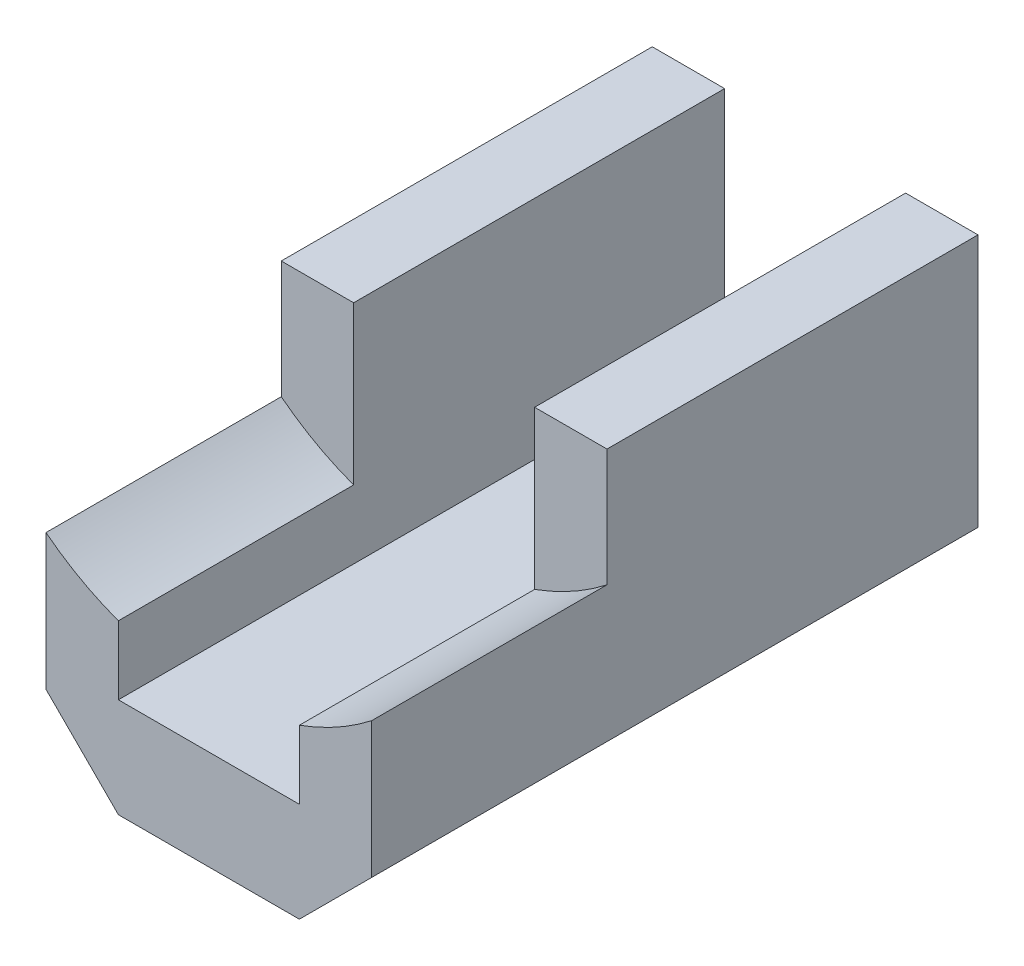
ISO-10303-21;
HEADER;
FILE_DESCRIPTION(('STEP AP214'),'2;1');
FILE_NAME('part.step','',(''),(''),'','','');
FILE_SCHEMA(('AUTOMOTIVE_DESIGN { 1 0 10303 214 1 1 1 1 }'));
ENDSEC;
DATA;
#1=APPLICATION_CONTEXT('core data for automotive mechanical design processes');
#2=APPLICATION_PROTOCOL_DEFINITION('international standard','automotive_design',2000,#1);
#3=PRODUCT_CONTEXT('',#1,'mechanical');
#4=PRODUCT('Part','Part','',(#3));
#5=PRODUCT_RELATED_PRODUCT_CATEGORY('part','',(#4));
#6=PRODUCT_DEFINITION_FORMATION('','',#4);
#7=PRODUCT_DEFINITION_CONTEXT('part definition',#1,'design');
#8=PRODUCT_DEFINITION('design','',#6,#7);
#9=PRODUCT_DEFINITION_SHAPE('','',#8);
#10=(LENGTH_UNIT() NAMED_UNIT(*) SI_UNIT(.MILLI.,.METRE.));
#11=(NAMED_UNIT(*) PLANE_ANGLE_UNIT() SI_UNIT($,.RADIAN.));
#12=(NAMED_UNIT(*) SI_UNIT($,.STERADIAN.) SOLID_ANGLE_UNIT());
#13=UNCERTAINTY_MEASURE_WITH_UNIT(LENGTH_MEASURE(1.E-05),#10,'distance_accuracy_value','');
#14=(GEOMETRIC_REPRESENTATION_CONTEXT(3) GLOBAL_UNCERTAINTY_ASSIGNED_CONTEXT((#13)) GLOBAL_UNIT_ASSIGNED_CONTEXT((#10,
#11,#12)) REPRESENTATION_CONTEXT('',''));
#15=CARTESIAN_POINT('',(0.,0.,0.));
#16=DIRECTION('',(0.,0.,1.));
#17=DIRECTION('',(1.,0.,0.));
#18=AXIS2_PLACEMENT_3D('',#15,#16,#17);
#19=CARTESIAN_POINT('',(9.,7.5,33.5));
#20=DIRECTION('',(-1.,0.,0.));
#21=DIRECTION('',(0.,0.,1.));
#22=AXIS2_PLACEMENT_3D('',#19,#20,#21);
#23=PLANE('',#22);
#24=DIRECTION('',(0.,1.,0.));
#25=VECTOR('',#24,1.);
#26=CARTESIAN_POINT('',(9.,7.5,33.5));
#27=LINE('',#26,#25);
#28=CARTESIAN_POINT('',(9.,-3.5,33.5));
#29=VERTEX_POINT('',#28);
#30=CARTESIAN_POINT('',(9.,4.00391370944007,33.5));
#31=VERTEX_POINT('',#30);
#32=EDGE_CURVE('E217',#29,#31,#27,.T.);
#33=ORIENTED_EDGE('',*,*,#32,.F.);
#34=DIRECTION('',(0.,0.,-1.));
#35=VECTOR('',#34,1.);
#36=CARTESIAN_POINT('',(9.,-3.5,33.5));
#37=LINE('',#36,#35);
#38=CARTESIAN_POINT('',(9.,-3.5,0.));
#39=VERTEX_POINT('',#38);
#40=EDGE_CURVE('E127',#29,#39,#37,.T.);
#41=ORIENTED_EDGE('',*,*,#40,.T.);
#42=DIRECTION('',(0.,1.,0.));
#43=VECTOR('',#42,1.);
#44=CARTESIAN_POINT('',(9.,7.5,0.));
#45=LINE('',#44,#43);
#46=CARTESIAN_POINT('',(9.,10.5,0.));
#47=VERTEX_POINT('',#46);
#48=EDGE_CURVE('E120',#39,#47,#45,.T.);
#49=ORIENTED_EDGE('',*,*,#48,.T.);
#50=DIRECTION('',(0.,0.,-1.));
#51=VECTOR('',#50,1.);
#52=CARTESIAN_POINT('',(9.,10.5,33.5));
#53=LINE('',#52,#51);
#54=CARTESIAN_POINT('',(9.,10.5,20.5));
#55=VERTEX_POINT('',#54);
#56=EDGE_CURVE('E124',#55,#47,#53,.T.);
#57=ORIENTED_EDGE('',*,*,#56,.F.);
#58=DIRECTION('',(0.,1.,0.));
#59=VECTOR('',#58,1.);
#60=CARTESIAN_POINT('',(9.,7.5,20.5));
#61=LINE('',#60,#59);
#62=CARTESIAN_POINT('',(9.,4.00391370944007,20.5));
#63=VERTEX_POINT('',#62);
#64=EDGE_CURVE('E167',#63,#55,#61,.T.);
#65=ORIENTED_EDGE('',*,*,#64,.F.);
#66=DIRECTION('',(0.,0.,1.));
#67=VECTOR('',#66,1.);
#68=CARTESIAN_POINT('',(9.,4.00391370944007,20.5));
#69=LINE('',#68,#67);
#70=EDGE_CURVE('E175',#63,#31,#69,.T.);
#71=ORIENTED_EDGE('',*,*,#70,.T.);
#72=EDGE_LOOP('',(#33,#41,#49,#57,#65,#71));
#73=FACE_BOUND('',#72,.T.);
#74=ADVANCED_FACE('F16',(#73),#23,.F.);
#75=CARTESIAN_POINT('',(-9.,7.5,33.5));
#76=DIRECTION('',(1.,0.,0.));
#77=DIRECTION('',(0.,1.,0.));
#78=AXIS2_PLACEMENT_3D('',#75,#76,#77);
#79=PLANE('',#78);
#80=DIRECTION('',(0.,-1.,0.));
#81=VECTOR('',#80,1.);
#82=CARTESIAN_POINT('',(-9.,7.5,0.));
#83=LINE('',#82,#81);
#84=CARTESIAN_POINT('',(-9.,10.5,0.));
#85=VERTEX_POINT('',#84);
#86=CARTESIAN_POINT('',(-9.,-3.5,0.));
#87=VERTEX_POINT('',#86);
#88=EDGE_CURVE('E130',#85,#87,#83,.T.);
#89=ORIENTED_EDGE('',*,*,#88,.T.);
#90=DIRECTION('',(0.,0.,1.));
#91=VECTOR('',#90,1.);
#92=CARTESIAN_POINT('',(-9.,-3.5,33.5));
#93=LINE('',#92,#91);
#94=CARTESIAN_POINT('',(-9.,-3.5,33.5));
#95=VERTEX_POINT('',#94);
#96=EDGE_CURVE('E11',#87,#95,#93,.T.);
#97=ORIENTED_EDGE('',*,*,#96,.T.);
#98=DIRECTION('',(0.,-1.,0.));
#99=VECTOR('',#98,1.);
#100=CARTESIAN_POINT('',(-9.,7.5,33.5));
#101=LINE('',#100,#99);
#102=CARTESIAN_POINT('',(-9.,4.00391370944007,33.5));
#103=VERTEX_POINT('',#102);
#104=EDGE_CURVE('E219',#103,#95,#101,.T.);
#105=ORIENTED_EDGE('',*,*,#104,.F.);
#106=DIRECTION('',(0.,0.,1.));
#107=VECTOR('',#106,1.);
#108=CARTESIAN_POINT('',(-9.,4.00391370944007,20.5));
#109=LINE('',#108,#107);
#110=CARTESIAN_POINT('',(-9.,4.00391370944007,20.5));
#111=VERTEX_POINT('',#110);
#112=EDGE_CURVE('E172',#103,#111,#109,.F.);
#113=ORIENTED_EDGE('',*,*,#112,.T.);
#114=DIRECTION('',(0.,-1.,0.));
#115=VECTOR('',#114,1.);
#116=CARTESIAN_POINT('',(-9.,7.5,20.5));
#117=LINE('',#116,#115);
#118=CARTESIAN_POINT('',(-9.,10.5,20.5));
#119=VERTEX_POINT('',#118);
#120=EDGE_CURVE('E160',#119,#111,#117,.T.);
#121=ORIENTED_EDGE('',*,*,#120,.F.);
#122=DIRECTION('',(0.,0.,-1.));
#123=VECTOR('',#122,1.);
#124=CARTESIAN_POINT('',(-9.,10.5,33.5));
#125=LINE('',#124,#123);
#126=EDGE_CURVE('E139',#119,#85,#125,.T.);
#127=ORIENTED_EDGE('',*,*,#126,.T.);
#128=EDGE_LOOP('',(#89,#97,#105,#113,#121,#127));
#129=FACE_BOUND('',#128,.T.);
#130=ADVANCED_FACE('F261',(#129),#79,.F.);
#131=CARTESIAN_POINT('',(-9.,-7.5,33.5));
#132=DIRECTION('',(0.,1.,0.));
#133=DIRECTION('',(0.,0.,1.));
#134=AXIS2_PLACEMENT_3D('',#131,#132,#133);
#135=PLANE('',#134);
#136=CARTESIAN_POINT('',(0.,-7.5,4.));
#137=DIRECTION('',(0.,-1.,0.));
#138=DIRECTION('',(0.,0.,-1.));
#139=AXIS2_PLACEMENT_3D('',#136,#137,#138);
#140=CIRCLE('',#139,3.25);
#141=CARTESIAN_POINT('',(0.,-7.5,0.75));
#142=VERTEX_POINT('',#141);
#143=EDGE_CURVE('E178',#142,#142,#140,.T.);
#144=ORIENTED_EDGE('',*,*,#143,.F.);
#145=EDGE_LOOP('',(#144));
#146=FACE_BOUND('',#145,.T.);
#147=CARTESIAN_POINT('',(0.,-7.5,11.));
#148=DIRECTION('',(0.,-1.,0.));
#149=DIRECTION('',(0.,0.,-1.));
#150=AXIS2_PLACEMENT_3D('',#147,#148,#149);
#151=CIRCLE('',#150,3.25);
#152=CARTESIAN_POINT('',(0.,-7.5,7.75));
#153=VERTEX_POINT('',#152);
#154=EDGE_CURVE('E188',#153,#153,#151,.T.);
#155=ORIENTED_EDGE('',*,*,#154,.F.);
#156=EDGE_LOOP('',(#155));
#157=FACE_BOUND('',#156,.T.);
#158=DIRECTION('',(1.,0.,0.));
#159=VECTOR('',#158,1.);
#160=CARTESIAN_POINT('',(-9.,-7.5,0.));
#161=LINE('',#160,#159);
#162=CARTESIAN_POINT('',(-5.,-7.5,0.));
#163=VERTEX_POINT('',#162);
#164=CARTESIAN_POINT('',(5.,-7.5,0.));
#165=VERTEX_POINT('',#164);
#166=EDGE_CURVE('E220',#163,#165,#161,.T.);
#167=ORIENTED_EDGE('',*,*,#166,.T.);
#168=DIRECTION('',(0.,0.,1.));
#169=VECTOR('',#168,1.);
#170=CARTESIAN_POINT('',(5.,-7.5,33.5));
#171=LINE('',#170,#169);
#172=CARTESIAN_POINT('',(5.,-7.5,33.5));
#173=VERTEX_POINT('',#172);
#174=EDGE_CURVE('E37',#165,#173,#171,.T.);
#175=ORIENTED_EDGE('',*,*,#174,.T.);
#176=DIRECTION('',(1.,0.,0.));
#177=VECTOR('',#176,1.);
#178=CARTESIAN_POINT('',(-9.,-7.5,33.5));
#179=LINE('',#178,#177);
#180=CARTESIAN_POINT('',(-5.,-7.5,33.5));
#181=VERTEX_POINT('',#180);
#182=EDGE_CURVE('E222',#181,#173,#179,.T.);
#183=ORIENTED_EDGE('',*,*,#182,.F.);
#184=DIRECTION('',(0.,0.,-1.));
#185=VECTOR('',#184,1.);
#186=CARTESIAN_POINT('',(-5.,-7.5,33.5));
#187=LINE('',#186,#185);
#188=EDGE_CURVE('E242',#181,#163,#187,.T.);
#189=ORIENTED_EDGE('',*,*,#188,.T.);
#190=EDGE_LOOP('',(#167,#175,#183,#189));
#191=FACE_BOUND('',#190,.T.);
#192=ADVANCED_FACE('F255',(#146,#157,#191),#135,.F.);
#193=CARTESIAN_POINT('',(0.,0.,33.5));
#194=DIRECTION('',(0.,0.,1.));
#195=DIRECTION('',(1.,0.,0.));
#196=AXIS2_PLACEMENT_3D('',#193,#194,#195);
#197=PLANE('',#196);
#198=ORIENTED_EDGE('',*,*,#182,.T.);
#199=DIRECTION('',(-0.707106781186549,-0.707106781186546,0.));
#200=VECTOR('',#199,1.);
#201=CARTESIAN_POINT('',(6.25,-6.25,33.5));
#202=LINE('',#201,#200);
#203=EDGE_CURVE('E24',#173,#29,#202,.F.);
#204=ORIENTED_EDGE('',*,*,#203,.T.);
#205=ORIENTED_EDGE('',*,*,#32,.T.);
#206=CARTESIAN_POINT('',(0.,15.5,33.5));
#207=DIRECTION('',(0.,0.,1.));
#208=DIRECTION('',(1.,0.,0.));
#209=AXIS2_PLACEMENT_3D('',#206,#207,#208);
#210=CIRCLE('',#209,14.6);
#211=CARTESIAN_POINT('',(5.,1.7828574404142,33.5));
#212=VERTEX_POINT('',#211);
#213=EDGE_CURVE('E157',#212,#31,#210,.T.);
#214=ORIENTED_EDGE('',*,*,#213,.F.);
#215=DIRECTION('',(0.,-1.,0.));
#216=VECTOR('',#215,1.);
#217=CARTESIAN_POINT('',(5.,-2.,33.5));
#218=LINE('',#217,#216);
#219=CARTESIAN_POINT('',(5.,-2.,33.5));
#220=VERTEX_POINT('',#219);
#221=EDGE_CURVE('E198',#212,#220,#218,.T.);
#222=ORIENTED_EDGE('',*,*,#221,.T.);
#223=DIRECTION('',(-1.,0.,0.));
#224=VECTOR('',#223,1.);
#225=CARTESIAN_POINT('',(-5.,-2.,33.5));
#226=LINE('',#225,#224);
#227=CARTESIAN_POINT('',(-5.,-2.,33.5));
#228=VERTEX_POINT('',#227);
#229=EDGE_CURVE('E200',#220,#228,#226,.T.);
#230=ORIENTED_EDGE('',*,*,#229,.T.);
#231=DIRECTION('',(0.,1.,0.));
#232=VECTOR('',#231,1.);
#233=CARTESIAN_POINT('',(-5.,-2.,33.5));
#234=LINE('',#233,#232);
#235=CARTESIAN_POINT('',(-5.,1.7828574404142,33.5));
#236=VERTEX_POINT('',#235);
#237=EDGE_CURVE('E204',#228,#236,#234,.T.);
#238=ORIENTED_EDGE('',*,*,#237,.T.);
#239=EDGE_CURVE('E162',#103,#236,#210,.T.);
#240=ORIENTED_EDGE('',*,*,#239,.F.);
#241=ORIENTED_EDGE('',*,*,#104,.T.);
#242=DIRECTION('',(-0.707106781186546,0.707106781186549,0.));
#243=VECTOR('',#242,1.);
#244=CARTESIAN_POINT('',(-6.25,-6.25,33.5));
#245=LINE('',#244,#243);
#246=EDGE_CURVE('E246',#95,#181,#245,.F.);
#247=ORIENTED_EDGE('',*,*,#246,.T.);
#248=EDGE_LOOP('',(#198,#204,#205,#214,#222,#230,#238,#240,#241,#247));
#249=FACE_BOUND('',#248,.T.);
#250=ADVANCED_FACE('F249',(#249),#197,.T.);
#251=CARTESIAN_POINT('',(0.,0.,0.));
#252=DIRECTION('',(0.,0.,1.));
#253=DIRECTION('',(1.,0.,0.));
#254=AXIS2_PLACEMENT_3D('',#251,#252,#253);
#255=PLANE('',#254);
#256=ORIENTED_EDGE('',*,*,#48,.F.);
#257=DIRECTION('',(0.707106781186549,0.707106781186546,0.));
#258=VECTOR('',#257,1.);
#259=CARTESIAN_POINT('',(9.,-3.5,0.));
#260=LINE('',#259,#258);
#261=EDGE_CURVE('E240',#39,#165,#260,.F.);
#262=ORIENTED_EDGE('',*,*,#261,.T.);
#263=ORIENTED_EDGE('',*,*,#166,.F.);
#264=DIRECTION('',(0.707106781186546,-0.707106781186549,0.));
#265=VECTOR('',#264,1.);
#266=CARTESIAN_POINT('',(-5.,-7.5,0.));
#267=LINE('',#266,#265);
#268=EDGE_CURVE('E238',#163,#87,#267,.F.);
#269=ORIENTED_EDGE('',*,*,#268,.T.);
#270=ORIENTED_EDGE('',*,*,#88,.F.);
#271=DIRECTION('',(-1.,0.,0.));
#272=VECTOR('',#271,1.);
#273=CARTESIAN_POINT('',(-9.,10.5,0.));
#274=LINE('',#273,#272);
#275=CARTESIAN_POINT('',(-5.,10.5,0.));
#276=VERTEX_POINT('',#275);
#277=EDGE_CURVE('E145',#276,#85,#274,.T.);
#278=ORIENTED_EDGE('',*,*,#277,.F.);
#279=DIRECTION('',(0.,1.,0.));
#280=VECTOR('',#279,1.);
#281=CARTESIAN_POINT('',(-5.,-2.,0.));
#282=LINE('',#281,#280);
#283=CARTESIAN_POINT('',(-5.,-2.,0.));
#284=VERTEX_POINT('',#283);
#285=EDGE_CURVE('E201',#284,#276,#282,.T.);
#286=ORIENTED_EDGE('',*,*,#285,.F.);
#287=DIRECTION('',(-1.,0.,0.));
#288=VECTOR('',#287,1.);
#289=CARTESIAN_POINT('',(-5.,-2.,0.));
#290=LINE('',#289,#288);
#291=CARTESIAN_POINT('',(5.,-2.,0.));
#292=VERTEX_POINT('',#291);
#293=EDGE_CURVE('E209',#292,#284,#290,.T.);
#294=ORIENTED_EDGE('',*,*,#293,.F.);
#295=DIRECTION('',(0.,-1.,0.));
#296=VECTOR('',#295,1.);
#297=CARTESIAN_POINT('',(5.,-2.,0.));
#298=LINE('',#297,#296);
#299=CARTESIAN_POINT('',(5.,10.5,0.));
#300=VERTEX_POINT('',#299);
#301=EDGE_CURVE('E144',#300,#292,#298,.T.);
#302=ORIENTED_EDGE('',*,*,#301,.F.);
#303=EDGE_CURVE('E135',#47,#300,#274,.T.);
#304=ORIENTED_EDGE('',*,*,#303,.F.);
#305=EDGE_LOOP('',(#256,#262,#263,#269,#270,#278,#286,#294,#302,#304));
#306=FACE_BOUND('',#305,.T.);
#307=ADVANCED_FACE('F142',(#306),#255,.F.);
#308=CARTESIAN_POINT('',(5.,-2.,33.5));
#309=DIRECTION('',(1.,0.,0.));
#310=DIRECTION('',(0.,0.,-1.));
#311=AXIS2_PLACEMENT_3D('',#308,#309,#310);
#312=PLANE('',#311);
#313=DIRECTION('',(0.,-1.,0.));
#314=VECTOR('',#313,1.);
#315=CARTESIAN_POINT('',(5.,-2.,20.5));
#316=LINE('',#315,#314);
#317=CARTESIAN_POINT('',(5.,10.5,20.5));
#318=VERTEX_POINT('',#317);
#319=CARTESIAN_POINT('',(5.,1.7828574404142,20.5));
#320=VERTEX_POINT('',#319);
#321=EDGE_CURVE('E165',#318,#320,#316,.T.);
#322=ORIENTED_EDGE('',*,*,#321,.F.);
#323=DIRECTION('',(0.,0.,-1.));
#324=VECTOR('',#323,1.);
#325=CARTESIAN_POINT('',(5.,10.5,33.5));
#326=LINE('',#325,#324);
#327=EDGE_CURVE('E149',#318,#300,#326,.T.);
#328=ORIENTED_EDGE('',*,*,#327,.T.);
#329=ORIENTED_EDGE('',*,*,#301,.T.);
#330=DIRECTION('',(0.,0.,-1.));
#331=VECTOR('',#330,1.);
#332=CARTESIAN_POINT('',(5.,-2.,33.5));
#333=LINE('',#332,#331);
#334=EDGE_CURVE('E207',#220,#292,#333,.T.);
#335=ORIENTED_EDGE('',*,*,#334,.F.);
#336=ORIENTED_EDGE('',*,*,#221,.F.);
#337=DIRECTION('',(0.,0.,1.));
#338=VECTOR('',#337,1.);
#339=CARTESIAN_POINT('',(5.,1.78285744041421,20.5));
#340=LINE('',#339,#338);
#341=EDGE_CURVE('E169',#212,#320,#340,.F.);
#342=ORIENTED_EDGE('',*,*,#341,.T.);
#343=EDGE_LOOP('',(#322,#328,#329,#335,#336,#342));
#344=FACE_BOUND('',#343,.T.);
#345=ADVANCED_FACE('F282',(#344),#312,.F.);
#346=CARTESIAN_POINT('',(-5.,-2.,33.5));
#347=DIRECTION('',(-1.,0.,0.));
#348=DIRECTION('',(0.,0.,1.));
#349=AXIS2_PLACEMENT_3D('',#346,#347,#348);
#350=PLANE('',#349);
#351=ORIENTED_EDGE('',*,*,#285,.T.);
#352=DIRECTION('',(0.,0.,1.));
#353=VECTOR('',#352,1.);
#354=CARTESIAN_POINT('',(-5.,10.5,33.5));
#355=LINE('',#354,#353);
#356=CARTESIAN_POINT('',(-5.,10.5,20.5));
#357=VERTEX_POINT('',#356);
#358=EDGE_CURVE('E154',#276,#357,#355,.T.);
#359=ORIENTED_EDGE('',*,*,#358,.T.);
#360=DIRECTION('',(0.,1.,0.));
#361=VECTOR('',#360,1.);
#362=CARTESIAN_POINT('',(-5.,-2.,20.5));
#363=LINE('',#362,#361);
#364=CARTESIAN_POINT('',(-5.,1.7828574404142,20.5));
#365=VERTEX_POINT('',#364);
#366=EDGE_CURVE('E223',#365,#357,#363,.T.);
#367=ORIENTED_EDGE('',*,*,#366,.F.);
#368=DIRECTION('',(0.,0.,1.));
#369=VECTOR('',#368,1.);
#370=CARTESIAN_POINT('',(-5.,1.78285744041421,20.5));
#371=LINE('',#370,#369);
#372=EDGE_CURVE('E233',#365,#236,#371,.T.);
#373=ORIENTED_EDGE('',*,*,#372,.T.);
#374=ORIENTED_EDGE('',*,*,#237,.F.);
#375=DIRECTION('',(0.,0.,-1.));
#376=VECTOR('',#375,1.);
#377=CARTESIAN_POINT('',(-5.,-2.,33.5));
#378=LINE('',#377,#376);
#379=EDGE_CURVE('E131',#228,#284,#378,.T.);
#380=ORIENTED_EDGE('',*,*,#379,.T.);
#381=EDGE_LOOP('',(#351,#359,#367,#373,#374,#380));
#382=FACE_BOUND('',#381,.T.);
#383=ADVANCED_FACE('F272',(#382),#350,.F.);
#384=CARTESIAN_POINT('',(-5.,-2.,33.5));
#385=DIRECTION('',(0.,-1.,0.));
#386=DIRECTION('',(0.,0.,-1.));
#387=AXIS2_PLACEMENT_3D('',#384,#385,#386);
#388=PLANE('',#387);
#389=CARTESIAN_POINT('',(0.,-2.,4.));
#390=DIRECTION('',(0.,-1.,0.));
#391=DIRECTION('',(0.,0.,-1.));
#392=AXIS2_PLACEMENT_3D('',#389,#390,#391);
#393=CIRCLE('',#392,1.7);
#394=CARTESIAN_POINT('',(0.,-2.,2.3));
#395=VERTEX_POINT('',#394);
#396=EDGE_CURVE('E187',#395,#395,#393,.T.);
#397=ORIENTED_EDGE('',*,*,#396,.T.);
#398=EDGE_LOOP('',(#397));
#399=FACE_BOUND('',#398,.T.);
#400=CARTESIAN_POINT('',(0.,-2.,11.));
#401=DIRECTION('',(0.,-1.,0.));
#402=DIRECTION('',(0.,0.,-1.));
#403=AXIS2_PLACEMENT_3D('',#400,#401,#402);
#404=CIRCLE('',#403,1.7);
#405=CARTESIAN_POINT('',(0.,-2.,9.3));
#406=VERTEX_POINT('',#405);
#407=EDGE_CURVE('E197',#406,#406,#404,.T.);
#408=ORIENTED_EDGE('',*,*,#407,.T.);
#409=EDGE_LOOP('',(#408));
#410=FACE_BOUND('',#409,.T.);
#411=ORIENTED_EDGE('',*,*,#293,.T.);
#412=ORIENTED_EDGE('',*,*,#379,.F.);
#413=ORIENTED_EDGE('',*,*,#229,.F.);
#414=ORIENTED_EDGE('',*,*,#334,.T.);
#415=EDGE_LOOP('',(#411,#412,#413,#414));
#416=FACE_BOUND('',#415,.T.);
#417=ADVANCED_FACE('F276',(#399,#410,#416),#388,.F.);
#418=CARTESIAN_POINT('',(0.,-7.5,11.));
#419=DIRECTION('',(0.,-1.,0.));
#420=DIRECTION('',(0.,0.,-1.));
#421=AXIS2_PLACEMENT_3D('',#418,#419,#420);
#422=CYLINDRICAL_SURFACE('',#421,1.7);
#423=CARTESIAN_POINT('',(0.,-4.1,11.));
#424=DIRECTION('',(0.,-1.,0.));
#425=DIRECTION('',(0.,0.,-1.));
#426=AXIS2_PLACEMENT_3D('',#423,#424,#425);
#427=CIRCLE('',#426,1.7);
#428=CARTESIAN_POINT('',(0.,-4.1,9.3));
#429=VERTEX_POINT('',#428);
#430=EDGE_CURVE('E194',#429,#429,#427,.T.);
#431=ORIENTED_EDGE('',*,*,#430,.T.);
#432=EDGE_LOOP('',(#431));
#433=FACE_BOUND('',#432,.T.);
#434=ORIENTED_EDGE('',*,*,#407,.F.);
#435=EDGE_LOOP('',(#434));
#436=FACE_BOUND('',#435,.T.);
#437=ADVANCED_FACE('F420',(#433,#436),#422,.F.);
#438=CARTESIAN_POINT('',(1.7,-4.1,11.));
#439=DIRECTION('',(0.,1.,0.));
#440=DIRECTION('',(0.,0.,1.));
#441=AXIS2_PLACEMENT_3D('',#438,#439,#440);
#442=PLANE('',#441);
#443=ORIENTED_EDGE('',*,*,#430,.F.);
#444=EDGE_LOOP('',(#443));
#445=FACE_BOUND('',#444,.T.);
#446=CARTESIAN_POINT('',(0.,-4.1,11.));
#447=DIRECTION('',(0.,-1.,0.));
#448=DIRECTION('',(0.,0.,-1.));
#449=AXIS2_PLACEMENT_3D('',#446,#447,#448);
#450=CIRCLE('',#449,3.25);
#451=CARTESIAN_POINT('',(0.,-4.1,7.75));
#452=VERTEX_POINT('',#451);
#453=EDGE_CURVE('E191',#452,#452,#450,.T.);
#454=ORIENTED_EDGE('',*,*,#453,.T.);
#455=EDGE_LOOP('',(#454));
#456=FACE_BOUND('',#455,.T.);
#457=ADVANCED_FACE('F410',(#445,#456),#442,.F.);
#458=CARTESIAN_POINT('',(0.,-7.5,11.));
#459=DIRECTION('',(0.,-1.,0.));
#460=DIRECTION('',(0.,0.,-1.));
#461=AXIS2_PLACEMENT_3D('',#458,#459,#460);
#462=CYLINDRICAL_SURFACE('',#461,3.25);
#463=ORIENTED_EDGE('',*,*,#453,.F.);
#464=EDGE_LOOP('',(#463));
#465=FACE_BOUND('',#464,.T.);
#466=ORIENTED_EDGE('',*,*,#154,.T.);
#467=EDGE_LOOP('',(#466));
#468=FACE_BOUND('',#467,.T.);
#469=ADVANCED_FACE('F400',(#465,#468),#462,.F.);
#470=CARTESIAN_POINT('',(0.,-7.5,4.));
#471=DIRECTION('',(0.,-1.,0.));
#472=DIRECTION('',(0.,0.,-1.));
#473=AXIS2_PLACEMENT_3D('',#470,#471,#472);
#474=CYLINDRICAL_SURFACE('',#473,1.7);
#475=CARTESIAN_POINT('',(0.,-4.1,4.));
#476=DIRECTION('',(0.,-1.,0.));
#477=DIRECTION('',(0.,0.,-1.));
#478=AXIS2_PLACEMENT_3D('',#475,#476,#477);
#479=CIRCLE('',#478,1.7);
#480=CARTESIAN_POINT('',(0.,-4.1,2.3));
#481=VERTEX_POINT('',#480);
#482=EDGE_CURVE('E184',#481,#481,#479,.T.);
#483=ORIENTED_EDGE('',*,*,#482,.T.);
#484=EDGE_LOOP('',(#483));
#485=FACE_BOUND('',#484,.T.);
#486=ORIENTED_EDGE('',*,*,#396,.F.);
#487=EDGE_LOOP('',(#486));
#488=FACE_BOUND('',#487,.T.);
#489=ADVANCED_FACE('F390',(#485,#488),#474,.F.);
#490=CARTESIAN_POINT('',(1.7,-4.1,4.));
#491=DIRECTION('',(0.,1.,0.));
#492=DIRECTION('',(0.,0.,1.));
#493=AXIS2_PLACEMENT_3D('',#490,#491,#492);
#494=PLANE('',#493);
#495=ORIENTED_EDGE('',*,*,#482,.F.);
#496=EDGE_LOOP('',(#495));
#497=FACE_BOUND('',#496,.T.);
#498=CARTESIAN_POINT('',(0.,-4.1,4.));
#499=DIRECTION('',(0.,-1.,0.));
#500=DIRECTION('',(0.,0.,-1.));
#501=AXIS2_PLACEMENT_3D('',#498,#499,#500);
#502=CIRCLE('',#501,3.25);
#503=CARTESIAN_POINT('',(0.,-4.1,0.75));
#504=VERTEX_POINT('',#503);
#505=EDGE_CURVE('E181',#504,#504,#502,.T.);
#506=ORIENTED_EDGE('',*,*,#505,.T.);
#507=EDGE_LOOP('',(#506));
#508=FACE_BOUND('',#507,.T.);
#509=ADVANCED_FACE('F381',(#497,#508),#494,.F.);
#510=CARTESIAN_POINT('',(0.,-7.5,4.));
#511=DIRECTION('',(0.,-1.,0.));
#512=DIRECTION('',(0.,0.,-1.));
#513=AXIS2_PLACEMENT_3D('',#510,#511,#512);
#514=CYLINDRICAL_SURFACE('',#513,3.25);
#515=ORIENTED_EDGE('',*,*,#505,.F.);
#516=EDGE_LOOP('',(#515));
#517=FACE_BOUND('',#516,.T.);
#518=ORIENTED_EDGE('',*,*,#143,.T.);
#519=EDGE_LOOP('',(#518));
#520=FACE_BOUND('',#519,.T.);
#521=ADVANCED_FACE('F300',(#517,#520),#514,.F.);
#522=CARTESIAN_POINT('',(0.,15.5,20.5));
#523=DIRECTION('',(0.,0.,1.));
#524=DIRECTION('',(1.,0.,0.));
#525=AXIS2_PLACEMENT_3D('',#522,#523,#524);
#526=PLANE('',#525);
#527=DIRECTION('',(1.,0.,0.));
#528=VECTOR('',#527,1.);
#529=CARTESIAN_POINT('',(0.,10.5,20.5));
#530=LINE('',#529,#528);
#531=EDGE_CURVE('E152',#119,#357,#530,.T.);
#532=ORIENTED_EDGE('',*,*,#531,.F.);
#533=ORIENTED_EDGE('',*,*,#120,.T.);
#534=CARTESIAN_POINT('',(0.,15.5,20.5));
#535=DIRECTION('',(0.,0.,1.));
#536=DIRECTION('',(1.,0.,0.));
#537=AXIS2_PLACEMENT_3D('',#534,#535,#536);
#538=CIRCLE('',#537,14.6);
#539=EDGE_CURVE('E158',#111,#365,#538,.T.);
#540=ORIENTED_EDGE('',*,*,#539,.T.);
#541=ORIENTED_EDGE('',*,*,#366,.T.);
#542=EDGE_LOOP('',(#532,#533,#540,#541));
#543=FACE_BOUND('',#542,.T.);
#544=ADVANCED_FACE('F267',(#543),#526,.T.);
#545=CARTESIAN_POINT('',(0.,15.5,20.5));
#546=DIRECTION('',(0.,0.,1.));
#547=DIRECTION('',(1.,0.,0.));
#548=AXIS2_PLACEMENT_3D('',#545,#546,#547);
#549=CYLINDRICAL_SURFACE('',#548,14.6);
#550=ORIENTED_EDGE('',*,*,#239,.T.);
#551=ORIENTED_EDGE('',*,*,#372,.F.);
#552=ORIENTED_EDGE('',*,*,#539,.F.);
#553=ORIENTED_EDGE('',*,*,#112,.F.);
#554=EDGE_LOOP('',(#550,#551,#552,#553));
#555=FACE_BOUND('',#554,.T.);
#556=ADVANCED_FACE('F291',(#555),#549,.F.);
#557=EDGE_CURVE('E161',#320,#63,#538,.T.);
#558=ORIENTED_EDGE('',*,*,#557,.F.);
#559=ORIENTED_EDGE('',*,*,#341,.F.);
#560=ORIENTED_EDGE('',*,*,#213,.T.);
#561=ORIENTED_EDGE('',*,*,#70,.F.);
#562=EDGE_LOOP('',(#558,#559,#560,#561));
#563=FACE_BOUND('',#562,.T.);
#564=ADVANCED_FACE('F288',(#563),#549,.F.);
#565=DIRECTION('',(1.,0.,0.));
#566=VECTOR('',#565,1.);
#567=CARTESIAN_POINT('',(0.,10.5,20.5));
#568=LINE('',#567,#566);
#569=EDGE_CURVE('E138',#318,#55,#568,.T.);
#570=ORIENTED_EDGE('',*,*,#569,.F.);
#571=ORIENTED_EDGE('',*,*,#321,.T.);
#572=ORIENTED_EDGE('',*,*,#557,.T.);
#573=ORIENTED_EDGE('',*,*,#64,.T.);
#574=EDGE_LOOP('',(#570,#571,#572,#573));
#575=FACE_BOUND('',#574,.T.);
#576=ADVANCED_FACE('F284',(#575),#526,.T.);
#577=CARTESIAN_POINT('',(-9.,10.5,33.5));
#578=DIRECTION('',(0.,-1.,0.));
#579=DIRECTION('',(1.,0.,0.));
#580=AXIS2_PLACEMENT_3D('',#577,#578,#579);
#581=PLANE('',#580);
#582=ORIENTED_EDGE('',*,*,#569,.T.);
#583=ORIENTED_EDGE('',*,*,#56,.T.);
#584=ORIENTED_EDGE('',*,*,#303,.T.);
#585=ORIENTED_EDGE('',*,*,#327,.F.);
#586=EDGE_LOOP('',(#582,#583,#584,#585));
#587=FACE_BOUND('',#586,.T.);
#588=ADVANCED_FACE('F134',(#587),#581,.F.);
#589=ORIENTED_EDGE('',*,*,#277,.T.);
#590=ORIENTED_EDGE('',*,*,#126,.F.);
#591=ORIENTED_EDGE('',*,*,#531,.T.);
#592=ORIENTED_EDGE('',*,*,#358,.F.);
#593=EDGE_LOOP('',(#589,#590,#591,#592));
#594=FACE_BOUND('',#593,.T.);
#595=ADVANCED_FACE('F265',(#594),#581,.F.);
#596=CARTESIAN_POINT('',(9.,-3.5,33.5));
#597=DIRECTION('',(-0.707106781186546,0.707106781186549,0.));
#598=DIRECTION('',(0.,0.,-1.));
#599=AXIS2_PLACEMENT_3D('',#596,#597,#598);
#600=PLANE('',#599);
#601=ORIENTED_EDGE('',*,*,#203,.F.);
#602=ORIENTED_EDGE('',*,*,#174,.F.);
#603=ORIENTED_EDGE('',*,*,#261,.F.);
#604=ORIENTED_EDGE('',*,*,#40,.F.);
#605=EDGE_LOOP('',(#601,#602,#603,#604));
#606=FACE_BOUND('',#605,.T.);
#607=ADVANCED_FACE('F253',(#606),#600,.F.);
#608=CARTESIAN_POINT('',(-5.,-7.5,33.5));
#609=DIRECTION('',(0.707106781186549,0.707106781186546,0.));
#610=DIRECTION('',(0.,0.,-1.));
#611=AXIS2_PLACEMENT_3D('',#608,#609,#610);
#612=PLANE('',#611);
#613=ORIENTED_EDGE('',*,*,#246,.F.);
#614=ORIENTED_EDGE('',*,*,#96,.F.);
#615=ORIENTED_EDGE('',*,*,#268,.F.);
#616=ORIENTED_EDGE('',*,*,#188,.F.);
#617=EDGE_LOOP('',(#613,#614,#615,#616));
#618=FACE_BOUND('',#617,.T.);
#619=ADVANCED_FACE('F18',(#618),#612,.F.);
#620=CLOSED_SHELL('',(#74,#130,#192,#250,#307,#345,#383,#417,#437,#457,#469,#489,#509,#521,#544,
#556,#564,#576,#588,#595,#607,#619));
#621=MANIFOLD_SOLID_BREP('B1',#620);
#622=ADVANCED_BREP_SHAPE_REPRESENTATION('',(#18,#621),#14);
#623=SHAPE_DEFINITION_REPRESENTATION(#9,#622);
ENDSEC;
END-ISO-10303-21;
